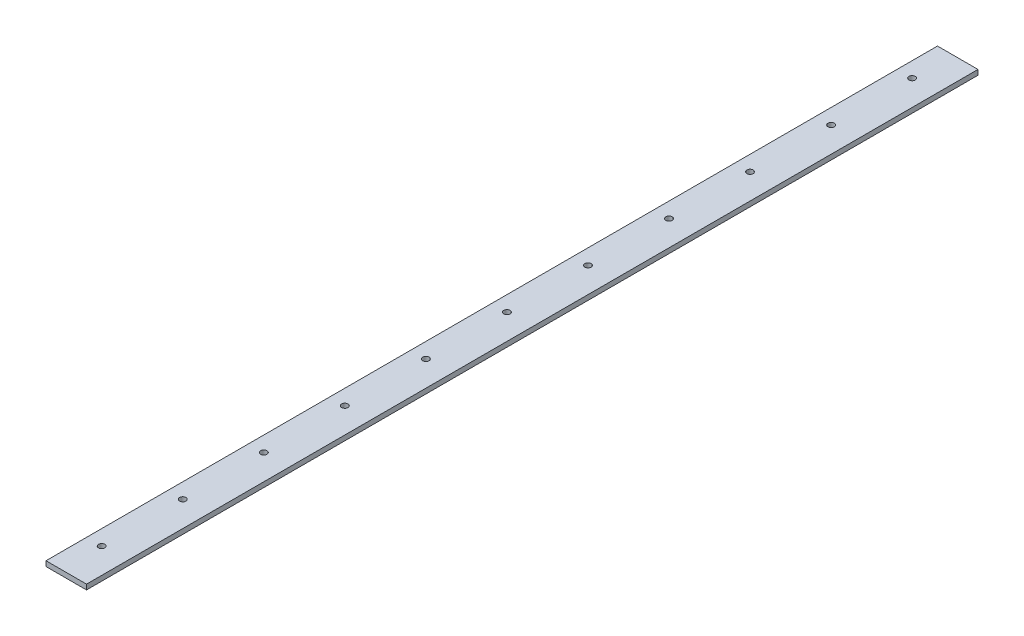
from build123d import *

# Parameters (mm, degrees)
SKETCH1_W      = 50.8
SKETCH1_H      = 6.35
EXTRUDE1_DEPTH = 1117.6
SKETCH3_R      = 3.9751
EXTRUDE3_DEPTH = 6.35


with BuildPart() as part:
    # Sketch1 → Extrude1 (new body)
    with BuildSketch(Plane.XY):
        Rectangle(SKETCH1_W, SKETCH1_H)
    extrude(amount=EXTRUDE1_DEPTH)

    # Sketch3 → Extrude3 (cut)
    with BuildSketch(Plane(origin=(0, 3.175, 0), x_dir=(1, 0, 0), z_dir=(0, 1, 0))):
        with Locations(Location((-6.35, -50.8, 0), (0, 0, 180))):
            Circle(SKETCH3_R)
        with Locations(Location((-6.35, -152.4, 0), (0, 0, 180))):
            Circle(SKETCH3_R)
        with Locations(Location((-6.35, -355.6, 0), (0, 0, 180))):
            Circle(SKETCH3_R)
        with Locations(Location((-6.35, -254, 0), (0, 0, 180))):
            Circle(SKETCH3_R)
        with Locations(Location((-6.35, -660.4, 0), (0, 0, 180))):
            Circle(SKETCH3_R)
        with Locations(Location((-6.35, -558.8, 0), (0, 0, 180))):
            Circle(SKETCH3_R)
        with Locations(Location((-6.35, -457.2, 0), (0, 0, 180))):
            Circle(SKETCH3_R)
        with Locations(Location((-6.35, -762, 0), (0, 0, 180))):
            Circle(SKETCH3_R)
        with Locations(Location((-6.35, -863.6, 0), (0, 0, 180))):
            Circle(SKETCH3_R)
        with Locations(Location((-6.35, -965.2, 0), (0, 0, 180))):
            Circle(SKETCH3_R)
        with Locations(Location((-6.35, -1066.8, 0), (0, 0, 180))):
            Circle(SKETCH3_R)
    extrude(amount=-EXTRUDE3_DEPTH, mode=Mode.SUBTRACT)


solid = part.part
